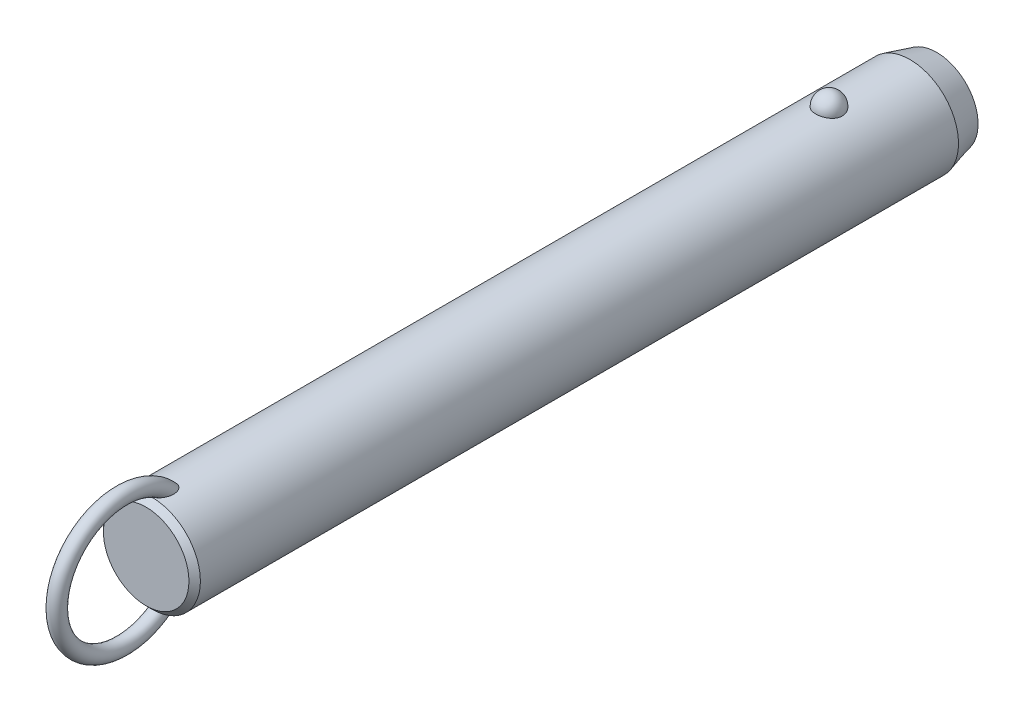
ISO-10303-21;
HEADER;
FILE_DESCRIPTION(('STEP AP214'),'2;1');
FILE_NAME('part.step','',(''),(''),'','','');
FILE_SCHEMA(('AUTOMOTIVE_DESIGN { 1 0 10303 214 1 1 1 1 }'));
ENDSEC;
DATA;
#1=APPLICATION_CONTEXT('core data for automotive mechanical design processes');
#2=APPLICATION_PROTOCOL_DEFINITION('international standard','automotive_design',2000,#1);
#3=PRODUCT_CONTEXT('',#1,'mechanical');
#4=PRODUCT('Part','Part','',(#3));
#5=PRODUCT_RELATED_PRODUCT_CATEGORY('part','',(#4));
#6=PRODUCT_DEFINITION_FORMATION('','',#4);
#7=PRODUCT_DEFINITION_CONTEXT('part definition',#1,'design');
#8=PRODUCT_DEFINITION('design','',#6,#7);
#9=PRODUCT_DEFINITION_SHAPE('','',#8);
#10=(LENGTH_UNIT() NAMED_UNIT(*) SI_UNIT(.MILLI.,.METRE.));
#11=(NAMED_UNIT(*) PLANE_ANGLE_UNIT() SI_UNIT($,.RADIAN.));
#12=(NAMED_UNIT(*) SI_UNIT($,.STERADIAN.) SOLID_ANGLE_UNIT());
#13=UNCERTAINTY_MEASURE_WITH_UNIT(LENGTH_MEASURE(1.E-05),#10,'distance_accuracy_value','');
#14=(GEOMETRIC_REPRESENTATION_CONTEXT(3) GLOBAL_UNCERTAINTY_ASSIGNED_CONTEXT((#13)) GLOBAL_UNIT_ASSIGNED_CONTEXT((#10,
#11,#12)) REPRESENTATION_CONTEXT('',''));
#15=CARTESIAN_POINT('',(0.,0.,0.));
#16=DIRECTION('',(0.,0.,1.));
#17=DIRECTION('',(1.,0.,0.));
#18=AXIS2_PLACEMENT_3D('',#15,#16,#17);
#19=CARTESIAN_POINT('',(0.,0.,162.6));
#20=DIRECTION('',(0.,0.,-1.));
#21=DIRECTION('',(-1.,0.,0.));
#22=AXIS2_PLACEMENT_3D('',#19,#20,#21);
#23=CYLINDRICAL_SURFACE('',#22,12.7);
#24=CARTESIAN_POINT('',(3.46661256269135,12.2177165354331,-3.50000000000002));
#25=CARTESIAN_POINT('',(3.4666090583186,12.2177194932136,-3.30432790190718));
#26=CARTESIAN_POINT('',(3.45063567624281,12.2222841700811,-3.10861112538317));
#27=CARTESIAN_POINT('',(3.38712451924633,12.2400345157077,-2.72271899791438));
#28=CARTESIAN_POINT('',(3.33957415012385,12.2532236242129,-2.53254588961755));
#29=CARTESIAN_POINT('',(3.2141234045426,12.286724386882,-2.16324948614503));
#30=CARTESIAN_POINT('',(3.13623639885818,12.3070329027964,-1.98412136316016));
#31=CARTESIAN_POINT('',(2.95205930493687,12.3525018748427,-1.6418059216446));
#32=CARTESIAN_POINT('',(2.84577003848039,12.3776621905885,-1.47861814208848));
#33=CARTESIAN_POINT('',(2.60688050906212,12.4301712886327,-1.17190583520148));
#34=CARTESIAN_POINT('',(2.47415697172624,12.4575299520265,-1.0284789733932));
#35=CARTESIAN_POINT('',(2.18615174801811,12.5112810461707,-0.766177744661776));
#36=CARTESIAN_POINT('',(2.03087002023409,12.5376734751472,-0.647303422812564));
#37=CARTESIAN_POINT('',(1.70237334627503,12.5864761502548,-0.437732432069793));
#38=CARTESIAN_POINT('',(1.52920948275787,12.6088972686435,-0.346958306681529));
#39=CARTESIAN_POINT('',(1.16944170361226,12.6473352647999,-0.195750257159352));
#40=CARTESIAN_POINT('',(0.982839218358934,12.663352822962,-0.135313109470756));
#41=CARTESIAN_POINT('',(0.604961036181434,12.6869706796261,-0.0473241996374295));
#42=CARTESIAN_POINT('',(0.41382314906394,12.6947125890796,-0.0192185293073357));
#43=CARTESIAN_POINT('',(0.0293827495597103,12.7014203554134,0.00517254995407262));
#44=CARTESIAN_POINT('',(-0.163919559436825,12.7003870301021,0.00146092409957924));
#45=CARTESIAN_POINT('',(-0.544374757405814,12.689735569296,-0.0373939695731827));
#46=CARTESIAN_POINT('',(-0.731575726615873,12.6802364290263,-0.0721015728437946));
#47=CARTESIAN_POINT('',(-1.09733277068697,12.6538333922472,-0.171364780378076));
#48=CARTESIAN_POINT('',(-1.27588869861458,12.6369293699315,-0.235920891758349));
#49=CARTESIAN_POINT('',(-1.6204698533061,12.5973946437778,-0.393548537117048));
#50=CARTESIAN_POINT('',(-1.78641865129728,12.5747321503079,-0.486778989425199));
#51=CARTESIAN_POINT('',(-2.10030671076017,12.5261316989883,-0.699110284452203));
#52=CARTESIAN_POINT('',(-2.24824419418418,12.5001934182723,-0.818213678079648));
#53=CARTESIAN_POINT('',(-2.52491489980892,12.4472906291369,-1.0815712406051));
#54=CARTESIAN_POINT('',(-2.65324222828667,12.4203160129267,-1.22624992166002));
#55=CARTESIAN_POINT('',(-2.88410007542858,12.3687509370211,-1.53528325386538));
#56=CARTESIAN_POINT('',(-2.98662883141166,12.3441606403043,-1.69963924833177));
#57=CARTESIAN_POINT('',(-3.16432417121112,12.2998199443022,-2.04548497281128));
#58=CARTESIAN_POINT('',(-3.23917525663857,12.2801261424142,-2.22714424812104));
#59=CARTESIAN_POINT('',(-3.35800573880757,12.248167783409,-2.60091389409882));
#60=CARTESIAN_POINT('',(-3.4019860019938,12.2359030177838,-2.79302397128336));
#61=CARTESIAN_POINT('',(-3.45784812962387,12.2202347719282,-3.18140279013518));
#62=CARTESIAN_POINT('',(-3.46986123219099,12.2167950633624,-3.37765118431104));
#63=CARTESIAN_POINT('',(-3.46186273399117,12.2190638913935,-3.76943689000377));
#64=CARTESIAN_POINT('',(-3.44185196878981,12.2247721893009,-3.96497421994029));
#65=CARTESIAN_POINT('',(-3.37048652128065,12.2446381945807,-4.34881728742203));
#66=CARTESIAN_POINT('',(-3.31928253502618,12.2587552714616,-4.53715319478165));
#67=CARTESIAN_POINT('',(-3.18693461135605,12.2938237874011,-4.9023172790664));
#68=CARTESIAN_POINT('',(-3.1057895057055,12.3147754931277,-5.07914500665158));
#69=CARTESIAN_POINT('',(-2.91506431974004,12.3613125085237,-5.41732059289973));
#70=CARTESIAN_POINT('',(-2.80533587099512,12.3869217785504,-5.57858147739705));
#71=CARTESIAN_POINT('',(-2.560414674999,12.4398525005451,-5.88013283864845));
#72=CARTESIAN_POINT('',(-2.42522099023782,12.4671740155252,-6.02042254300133));
#73=CARTESIAN_POINT('',(-2.1323357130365,12.5205965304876,-6.27662798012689));
#74=CARTESIAN_POINT('',(-1.97456596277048,12.5466928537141,-6.39245542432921));
#75=CARTESIAN_POINT('',(-1.64115839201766,12.5946384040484,-6.59583547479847));
#76=CARTESIAN_POINT('',(-1.46552179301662,12.6164879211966,-6.68339001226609));
#77=CARTESIAN_POINT('',(-1.10356050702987,12.6532533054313,-6.82682153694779));
#78=CARTESIAN_POINT('',(-0.9173913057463,12.6682500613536,-6.88306988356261));
#79=CARTESIAN_POINT('',(-0.537836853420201,12.6900288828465,-6.96386887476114));
#80=CARTESIAN_POINT('',(-0.344452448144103,12.6968119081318,-6.98842322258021));
#81=CARTESIAN_POINT('',(0.0402577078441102,12.7013667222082,-7.00496469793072));
#82=CARTESIAN_POINT('',(0.231556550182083,12.6993008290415,-6.99753844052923));
#83=CARTESIAN_POINT('',(0.610105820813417,12.6867505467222,-6.95166366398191));
#84=CARTESIAN_POINT('',(0.797356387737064,12.6762664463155,-6.91321620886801));
#85=CARTESIAN_POINT('',(1.16186657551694,12.6480587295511,-6.80658431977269));
#86=CARTESIAN_POINT('',(1.33915951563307,12.6303611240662,-6.73850666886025));
#87=CARTESIAN_POINT('',(1.67968518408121,12.5896027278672,-6.57450875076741));
#88=CARTESIAN_POINT('',(1.84291705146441,12.5665416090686,-6.47858678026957));
#89=CARTESIAN_POINT('',(2.15340192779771,12.5171072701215,-6.25982455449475));
#90=CARTESIAN_POINT('',(2.30037831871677,12.4906895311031,-6.13660186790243));
#91=CARTESIAN_POINT('',(2.5717412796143,12.4376567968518,-5.86739587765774));
#92=CARTESIAN_POINT('',(2.69612388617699,12.4110417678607,-5.72140858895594));
#93=CARTESIAN_POINT('',(2.92107785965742,12.360051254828,-5.40794137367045));
#94=CARTESIAN_POINT('',(3.02121329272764,12.3357209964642,-5.24014110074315));
#95=CARTESIAN_POINT('',(3.19236291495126,12.2925446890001,-4.88969865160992));
#96=CARTESIAN_POINT('',(3.26338839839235,12.2736965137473,-4.70706226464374));
#97=CARTESIAN_POINT('',(3.36788038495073,12.245404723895,-4.35469510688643));
#98=CARTESIAN_POINT('',(3.40484026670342,12.2351018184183,-4.18605935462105));
#99=CARTESIAN_POINT('',(3.45420764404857,12.2212564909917,-3.84496058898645));
#100=CARTESIAN_POINT('',(3.46661565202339,12.2177139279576,-3.67249765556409));
#101=CARTESIAN_POINT('',(3.46661256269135,12.2177165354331,-3.50000000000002));
#102=B_SPLINE_CURVE_WITH_KNOTS('',3,(#24,#25,#26,#27,#28,#29,#30,#31,#32,#33,#34,#35,#36,#37,
#38,#39,#40,#41,#42,#43,#44,#45,#46,#47,#48,#49,#50,#51,#52,#53,#54,#55,#56,#57,#58,#59,#60,#61,
#62,#63,#64,#65,#66,#67,#68,#69,#70,#71,#72,#73,#74,#75,#76,#77,#78,#79,#80,#81,#82,#83,#84,#85,
#86,#87,#88,#89,#90,#91,#92,#93,#94,#95,#96,#97,#98,#99,#100,#101),.UNSPECIFIED.,.T.,.F.,(4,2,2,
2,2,2,2,2,2,2,2,2,2,2,2,2,2,2,2,2,2,2,2,2,2,2,2,2,2,2,2,2,2,2,2,2,2,2,4),(0.,0.586396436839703,
1.17302689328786,1.7593990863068,2.34575431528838,2.93491084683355,3.52406845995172,
4.11158733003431,4.69904375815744,5.2762784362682,5.85345931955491,6.42265312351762,
6.99185659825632,7.56427334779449,8.136746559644,8.71981013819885,9.3029135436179,
9.89247258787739,10.4820150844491,11.0691335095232,11.6562366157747,12.2405256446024,
12.8248374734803,13.412244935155,13.9996740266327,14.5891883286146,15.1786623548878,
15.7609861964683,16.3432419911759,16.9148635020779,17.4864654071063,18.0560241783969,
18.6256177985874,19.2037609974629,19.7820055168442,20.3699810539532,20.957728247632,
21.4746855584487,21.9916320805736),.UNSPECIFIED.);
#103=CARTESIAN_POINT('',(3.46661256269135,12.2177165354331,-3.50000000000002));
#104=VERTEX_POINT('',#103);
#105=EDGE_CURVE('E41',#104,#104,#102,.T.);
#106=ORIENTED_EDGE('',*,*,#105,.T.);
#107=EDGE_LOOP('',(#106));
#108=FACE_BOUND('',#107,.T.);
#109=CARTESIAN_POINT('',(0.,0.,173.8));
#110=DIRECTION('',(0.,0.,1.));
#111=DIRECTION('',(1.,0.,0.));
#112=AXIS2_PLACEMENT_3D('',#109,#110,#111);
#113=CIRCLE('',#112,12.7);
#114=CARTESIAN_POINT('',(12.7,0.,173.8));
#115=VERTEX_POINT('',#114);
#116=EDGE_CURVE('E10',#115,#115,#113,.F.);
#117=ORIENTED_EDGE('',*,*,#116,.T.);
#118=EDGE_LOOP('',(#117));
#119=FACE_BOUND('',#118,.T.);
#120=CARTESIAN_POINT('',(-0.548122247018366,-12.6881662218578,167.543218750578));
#121=CARTESIAN_POINT('',(-0.648865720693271,-12.6838128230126,167.577926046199));
#122=CARTESIAN_POINT('',(-0.746398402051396,-12.6783867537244,167.622042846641));
#123=CARTESIAN_POINT('',(-0.932125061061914,-12.666091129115,167.726764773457));
#124=CARTESIAN_POINT('',(-1.02030388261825,-12.6592192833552,167.787396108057));
#125=CARTESIAN_POINT('',(-1.18487740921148,-12.6448747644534,167.921847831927));
#126=CARTESIAN_POINT('',(-1.26134296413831,-12.637406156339,167.995582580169));
#127=CARTESIAN_POINT('',(-1.4023120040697,-12.6225412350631,168.153604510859));
#128=CARTESIAN_POINT('',(-1.466814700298,-12.6151449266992,168.23789238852));
#129=CARTESIAN_POINT('',(-1.60714786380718,-12.5981718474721,168.449657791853));
#130=CARTESIAN_POINT('',(-1.67725126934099,-12.588900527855,168.580962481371));
#131=CARTESIAN_POINT('',(-1.79536591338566,-12.5725964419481,168.853247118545));
#132=CARTESIAN_POINT('',(-1.84333535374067,-12.5655679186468,168.994244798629));
#133=CARTESIAN_POINT('',(-1.93422576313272,-12.5519624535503,169.337645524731));
#134=CARTESIAN_POINT('',(-1.96788773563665,-12.5466298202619,169.542557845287));
#135=CARTESIAN_POINT('',(-1.9941399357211,-12.542463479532,169.851760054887));
#136=CARTESIAN_POINT('',(-1.99883864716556,-12.5417153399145,169.955298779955));
#137=CARTESIAN_POINT('',(-2.00078003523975,-12.5414074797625,170.16245124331));
#138=CARTESIAN_POINT('',(-1.99802449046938,-12.5418474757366,170.266064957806));
#139=CARTESIAN_POINT('',(-1.98336733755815,-12.5441750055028,170.51032076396));
#140=CARTESIAN_POINT('',(-1.96851430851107,-12.5465291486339,170.650780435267));
#141=CARTESIAN_POINT('',(-1.92707089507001,-12.5529612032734,170.929960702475));
#142=CARTESIAN_POINT('',(-1.90047458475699,-12.5570399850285,171.068680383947));
#143=CARTESIAN_POINT('',(-1.83619120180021,-12.5666008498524,171.34341135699));
#144=CARTESIAN_POINT('',(-1.79850828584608,-12.57208240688,171.479423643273));
#145=CARTESIAN_POINT('',(-1.71223796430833,-12.5841228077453,171.747842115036));
#146=CARTESIAN_POINT('',(-1.66365679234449,-12.5906810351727,171.880250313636));
#147=CARTESIAN_POINT('',(-1.57804503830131,-12.6016176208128,172.08548877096));
#148=CARTESIAN_POINT('',(-1.54477252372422,-12.6057501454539,172.159914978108));
#149=CARTESIAN_POINT('',(-1.47424480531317,-12.6141930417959,172.306839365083));
#150=CARTESIAN_POINT('',(-1.43699041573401,-12.6185033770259,172.379337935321));
#151=CARTESIAN_POINT('',(-1.35825795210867,-12.6272207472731,172.521892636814));
#152=CARTESIAN_POINT('',(-1.31678520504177,-12.6316276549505,172.591951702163));
#153=CARTESIAN_POINT('',(-1.22917793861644,-12.6404532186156,172.729070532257));
#154=CARTESIAN_POINT('',(-1.18304514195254,-12.6448718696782,172.796131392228));
#155=CARTESIAN_POINT('',(-1.07246411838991,-12.6547893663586,172.943874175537));
#156=CARTESIAN_POINT('',(-1.0064223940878,-12.6602600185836,173.023384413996));
#157=CARTESIAN_POINT('',(-0.864441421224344,-12.6707460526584,173.173169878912));
#158=CARTESIAN_POINT('',(-0.788516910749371,-12.6757620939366,173.243458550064));
#159=CARTESIAN_POINT('',(-0.652215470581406,-12.6833591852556,173.348680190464));
#160=CARTESIAN_POINT('',(-0.594982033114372,-12.6861973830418,173.387624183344));
#161=CARTESIAN_POINT('',(-0.475269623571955,-12.6912445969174,173.456489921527));
#162=CARTESIAN_POINT('',(-0.412800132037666,-12.6934547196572,173.486427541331));
#163=CARTESIAN_POINT('',(-0.295749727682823,-12.6966636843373,173.52975652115));
#164=CARTESIAN_POINT('',(-0.2419499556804,-12.6978134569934,173.545218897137));
#165=CARTESIAN_POINT('',(-0.13250810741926,-12.6994261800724,173.566884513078));
#166=CARTESIAN_POINT('',(-0.0768679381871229,-12.6998898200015,173.573097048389));
#167=CARTESIAN_POINT('',(0.0347696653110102,-12.7000752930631,173.575583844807));
#168=CARTESIAN_POINT('',(0.0907676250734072,-12.6997954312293,173.571835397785));
#169=CARTESIAN_POINT('',(0.20128301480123,-12.6985255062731,173.554788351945));
#170=CARTESIAN_POINT('',(0.255799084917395,-12.6975348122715,173.541481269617));
#171=CARTESIAN_POINT('',(0.376042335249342,-12.6946091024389,173.50203792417));
#172=CARTESIAN_POINT('',(0.440950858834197,-12.6924943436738,173.473449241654));
#173=CARTESIAN_POINT('',(0.56535027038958,-12.6875639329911,173.406323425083));
#174=CARTESIAN_POINT('',(0.624828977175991,-12.6847467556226,173.367764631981));
#175=CARTESIAN_POINT('',(0.774116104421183,-12.6767252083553,173.256949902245));
#176=CARTESIAN_POINT('',(0.859449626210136,-12.6711344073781,173.178760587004));
#177=CARTESIAN_POINT('',(1.01789440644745,-12.6593922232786,173.010943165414));
#178=CARTESIAN_POINT('',(1.09096902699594,-12.653239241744,172.921282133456));
#179=CARTESIAN_POINT('',(1.22268793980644,-12.6411674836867,172.740265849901));
#180=CARTESIAN_POINT('',(1.28193986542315,-12.6352572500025,172.649345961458));
#181=CARTESIAN_POINT('',(1.39259777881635,-12.6235401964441,172.462792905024));
#182=CARTESIAN_POINT('',(1.44399707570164,-12.6177334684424,172.367155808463));
#183=CARTESIAN_POINT('',(1.53972870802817,-12.6064093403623,172.172273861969));
#184=CARTESIAN_POINT('',(1.58405262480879,-12.6008922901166,172.073024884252));
#185=CARTESIAN_POINT('',(1.66600705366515,-12.5903187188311,171.871772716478));
#186=CARTESIAN_POINT('',(1.70363651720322,-12.5852622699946,171.769769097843));
#187=CARTESIAN_POINT('',(1.77545379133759,-12.5753406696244,171.554358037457));
#188=CARTESIAN_POINT('',(1.80903453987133,-12.5705328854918,171.440745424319));
#189=CARTESIAN_POINT('',(1.86844163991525,-12.5618400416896,171.211457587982));
#190=CARTESIAN_POINT('',(1.89426665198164,-12.5579551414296,171.095782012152));
#191=CARTESIAN_POINT('',(1.93785464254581,-12.5513030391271,170.863007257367));
#192=CARTESIAN_POINT('',(1.95562640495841,-12.5485346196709,170.745909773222));
#193=CARTESIAN_POINT('',(1.98264463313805,-12.5442934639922,170.510747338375));
#194=CARTESIAN_POINT('',(1.99189298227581,-12.5428204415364,170.39268260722));
#195=CARTESIAN_POINT('',(2.00416068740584,-12.540871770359,170.080622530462));
#196=CARTESIAN_POINT('',(1.99944433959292,-12.541631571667,169.886229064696));
#197=CARTESIAN_POINT('',(1.9611375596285,-12.5476846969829,169.500309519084));
#198=CARTESIAN_POINT('',(1.92758341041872,-12.5529723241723,169.308780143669));
#199=CARTESIAN_POINT('',(1.83934342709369,-12.5661532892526,168.982272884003));
#200=CARTESIAN_POINT('',(1.79215440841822,-12.5730485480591,168.84524997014));
#201=CARTESIAN_POINT('',(1.67676242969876,-12.588958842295,168.580445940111));
#202=CARTESIAN_POINT('',(1.60859050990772,-12.597970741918,168.452651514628));
#203=CARTESIAN_POINT('',(1.4658383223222,-12.6152829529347,168.235800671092));
#204=CARTESIAN_POINT('',(1.39525727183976,-12.6233659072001,168.14410500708));
#205=CARTESIAN_POINT('',(1.23992594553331,-12.6395676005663,167.973485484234));
#206=CARTESIAN_POINT('',(1.1551793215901,-12.6476863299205,167.894558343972));
#207=CARTESIAN_POINT('',(0.971995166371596,-12.6630846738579,167.752643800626));
#208=CARTESIAN_POINT('',(0.873456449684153,-12.6703572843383,167.689784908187));
#209=CARTESIAN_POINT('',(0.665847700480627,-12.6829569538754,167.584487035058));
#210=CARTESIAN_POINT('',(0.556784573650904,-12.688285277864,167.542034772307));
#211=CARTESIAN_POINT('',(0.347338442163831,-12.6956226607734,167.484443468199));
#212=CARTESIAN_POINT('',(0.247759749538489,-12.6979816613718,167.466399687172));
#213=CARTESIAN_POINT('',(0.047021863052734,-12.7003077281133,167.448600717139));
#214=CARTESIAN_POINT('',(-0.0541350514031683,-12.7002779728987,167.448821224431));
#215=CARTESIAN_POINT('',(-0.221414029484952,-12.6982482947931,167.464363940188));
#216=CARTESIAN_POINT('',(-0.288055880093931,-12.6969033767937,167.474666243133));
#217=CARTESIAN_POINT('',(-0.419599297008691,-12.6932369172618,167.50313489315));
#218=CARTESIAN_POINT('',(-0.484501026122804,-12.6909154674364,167.521300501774));
#219=CARTESIAN_POINT('',(-0.548122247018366,-12.6881662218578,167.543218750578));
#220=B_SPLINE_CURVE_WITH_KNOTS('',3,(#120,#121,#122,#123,#124,#125,#126,#127,#128,#129,#130,
#131,#132,#133,#134,#135,#136,#137,#138,#139,#140,#141,#142,#143,#144,#145,#146,#147,#148,#149,
#150,#151,#152,#153,#154,#155,#156,#157,#158,#159,#160,#161,#162,#163,#164,#165,#166,#167,#168,
#169,#170,#171,#172,#173,#174,#175,#176,#177,#178,#179,#180,#181,#182,#183,#184,#185,#186,#187,
#188,#189,#190,#191,#192,#193,#194,#195,#196,#197,#198,#199,#200,#201,#202,#203,#204,#205,#206,
#207,#208,#209,#210,#211,#212,#213,#214,#215,#216,#217,#218,#219),.UNSPECIFIED.,.T.,.F.,(4,2,2,
2,2,2,2,2,2,2,2,2,2,2,2,2,2,2,2,2,2,2,2,2,2,2,2,2,2,2,2,2,2,2,2,2,2,2,2,2,2,2,2,2,2,2,2,2,2,4),
(0.,0.31964225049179,0.639794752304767,0.957927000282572,1.27608021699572,1.72100165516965,
2.16675988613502,2.78630021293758,3.09705782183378,3.40774128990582,3.83096358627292,
4.25439969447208,4.67767724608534,5.1007133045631,5.34550297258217,5.59024267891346,
5.83467707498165,6.07902143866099,6.38891080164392,6.69834321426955,6.90560910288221,
7.11250749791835,7.27977315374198,7.44687060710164,7.61434932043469,7.78197685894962,
7.99365544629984,8.20579780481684,8.55147335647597,8.89816429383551,9.22375138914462,
9.54961437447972,9.87586224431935,10.202161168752,10.5575872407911,10.9130746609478,
11.2681734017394,11.6231936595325,12.2046601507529,12.7853961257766,13.219164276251,
13.6522938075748,13.9989174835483,14.3454519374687,14.6946768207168,15.0436740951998,
15.3457513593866,15.6474266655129,15.8493051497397,16.0511646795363),.UNSPECIFIED.);
#221=CARTESIAN_POINT('',(-0.548122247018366,-12.6881662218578,167.543218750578));
#222=VERTEX_POINT('',#221);
#223=EDGE_CURVE('E59',#222,#222,#220,.T.);
#224=ORIENTED_EDGE('',*,*,#223,.T.);
#225=EDGE_LOOP('',(#224));
#226=FACE_BOUND('',#225,.T.);
#227=CARTESIAN_POINT('',(-0.548122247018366,12.6881662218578,167.543218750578));
#228=CARTESIAN_POINT('',(-0.459436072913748,12.6919968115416,167.512673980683));
#229=CARTESIAN_POINT('',(-0.368189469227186,12.6949996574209,167.489391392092));
#230=CARTESIAN_POINT('',(-0.183024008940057,12.6990186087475,167.458406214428));
#231=CARTESIAN_POINT('',(-0.089104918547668,12.7000345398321,167.450704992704));
#232=CARTESIAN_POINT('',(0.0987147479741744,12.6999636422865,167.451245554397));
#233=CARTESIAN_POINT('',(0.192615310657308,12.6988761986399,167.459492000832));
#234=CARTESIAN_POINT('',(0.377658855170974,12.6947211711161,167.491551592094));
#235=CARTESIAN_POINT('',(0.468801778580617,12.6916535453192,167.515365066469));
#236=CARTESIAN_POINT('',(0.645809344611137,12.6838788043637,167.57745651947));
#237=CARTESIAN_POINT('',(0.731679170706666,12.6791733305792,167.615720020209));
#238=CARTESIAN_POINT('',(0.896315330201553,12.6686004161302,167.705120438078));
#239=CARTESIAN_POINT('',(0.97508059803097,12.6627328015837,167.756259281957));
#240=CARTESIAN_POINT('',(1.12963655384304,12.6499161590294,167.87367820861));
#241=CARTESIAN_POINT('',(1.20478673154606,12.6429194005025,167.940792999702));
#242=CARTESIAN_POINT('',(1.34448241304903,12.6288282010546,168.08522507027));
#243=CARTESIAN_POINT('',(1.40902173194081,12.621733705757,168.162548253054));
#244=CARTESIAN_POINT('',(1.55208211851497,12.6050877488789,168.359247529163));
#245=CARTESIAN_POINT('',(1.62510490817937,12.5957546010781,168.482654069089));
#246=CARTESIAN_POINT('',(1.7501904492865,12.5789823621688,168.739769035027));
#247=CARTESIAN_POINT('',(1.8022137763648,12.5715468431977,168.873496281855));
#248=CARTESIAN_POINT('',(1.90309965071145,12.5567434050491,169.198351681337));
#249=CARTESIAN_POINT('',(1.94342317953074,12.5504515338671,169.392161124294));
#250=CARTESIAN_POINT('',(1.99332997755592,12.5426147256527,169.78378810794));
#251=CARTESIAN_POINT('',(2.00285305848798,12.5410790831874,169.981612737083));
#252=CARTESIAN_POINT('',(1.99678999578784,12.5420407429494,170.316642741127));
#253=CARTESIAN_POINT('',(1.98794117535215,12.5434564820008,170.454042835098));
#254=CARTESIAN_POINT('',(1.95865119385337,12.5480641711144,170.727639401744));
#255=CARTESIAN_POINT('',(1.93820436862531,12.5512569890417,170.863835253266));
#256=CARTESIAN_POINT('',(1.88647896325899,12.5591352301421,171.134249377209));
#257=CARTESIAN_POINT('',(1.85518800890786,12.5638223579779,171.268465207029));
#258=CARTESIAN_POINT('',(1.78217886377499,12.5743868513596,171.533936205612));
#259=CARTESIAN_POINT('',(1.74046509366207,12.5802637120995,171.665192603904));
#260=CARTESIAN_POINT('',(1.66024095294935,12.5910571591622,171.886085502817));
#261=CARTESIAN_POINT('',(1.62434772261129,12.5957535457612,171.976690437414));
#262=CARTESIAN_POINT('',(1.54709009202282,12.6054762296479,172.155512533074));
#263=CARTESIAN_POINT('',(1.50572681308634,12.6105024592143,172.243730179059));
#264=CARTESIAN_POINT('',(1.41728020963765,12.620748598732,172.416932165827));
#265=CARTESIAN_POINT('',(1.37021377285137,12.625967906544,172.501925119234));
#266=CARTESIAN_POINT('',(1.26969620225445,12.6364721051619,172.668007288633));
#267=CARTESIAN_POINT('',(1.21624929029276,12.6417569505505,172.749099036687));
#268=CARTESIAN_POINT('',(1.1030441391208,12.6521331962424,172.904702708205));
#269=CARTESIAN_POINT('',(1.04340936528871,12.657226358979,172.979303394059));
#270=CARTESIAN_POINT('',(0.915919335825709,12.667090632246,173.121324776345));
#271=CARTESIAN_POINT('',(0.848064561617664,12.6718617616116,173.18874589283));
#272=CARTESIAN_POINT('',(0.717035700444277,12.67987711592,173.300624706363));
#273=CARTESIAN_POINT('',(0.655526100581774,12.6832377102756,173.346997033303));
#274=CARTESIAN_POINT('',(0.525985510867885,12.6892676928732,173.429619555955));
#275=CARTESIAN_POINT('',(0.457969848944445,12.6919386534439,173.465892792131));
#276=CARTESIAN_POINT('',(0.334859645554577,12.695691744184,173.516657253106));
#277=CARTESIAN_POINT('',(0.281116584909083,12.6970073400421,173.534373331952));
#278=CARTESIAN_POINT('',(0.171425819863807,12.6989609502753,173.560642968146));
#279=CARTESIAN_POINT('',(0.115480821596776,12.699599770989,173.569207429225));
#280=CARTESIAN_POINT('',(0.00272618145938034,12.7001251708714,173.576253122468));
#281=CARTESIAN_POINT('',(-0.0540859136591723,12.7000089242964,173.574696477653));
#282=CARTESIAN_POINT('',(-0.16654462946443,12.6990328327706,173.561600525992));
#283=CARTESIAN_POINT('',(-0.222190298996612,12.6981724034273,173.550053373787));
#284=CARTESIAN_POINT('',(-0.342018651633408,12.695562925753,173.514912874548));
#285=CARTESIAN_POINT('',(-0.405606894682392,12.6936676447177,173.48933225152));
#286=CARTESIAN_POINT('',(-0.527815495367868,12.6891754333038,173.428311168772));
#287=CARTESIAN_POINT('',(-0.586425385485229,12.6865770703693,173.392850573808));
#288=CARTESIAN_POINT('',(-0.731842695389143,12.6792129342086,173.291496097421));
#289=CARTESIAN_POINT('',(-0.81470941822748,12.6740767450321,173.2200395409));
#290=CARTESIAN_POINT('',(-0.969101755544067,12.6632083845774,173.06589007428));
#291=CARTESIAN_POINT('',(-1.04059564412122,12.6574746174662,172.983166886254));
#292=CARTESIAN_POINT('',(-1.16981116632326,12.6461638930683,172.815809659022));
#293=CARTESIAN_POINT('',(-1.22811369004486,12.6405994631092,172.731616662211));
#294=CARTESIAN_POINT('',(-1.33743405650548,12.6295007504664,172.558579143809));
#295=CARTESIAN_POINT('',(-1.38844577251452,12.6239664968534,172.469730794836));
#296=CARTESIAN_POINT('',(-1.48400702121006,12.6130898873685,172.288389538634));
#297=CARTESIAN_POINT('',(-1.52854232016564,12.6077479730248,172.195889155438));
#298=CARTESIAN_POINT('',(-1.61150113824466,12.5974127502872,172.008160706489));
#299=CARTESIAN_POINT('',(-1.64992317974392,12.5924195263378,171.912931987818));
#300=CARTESIAN_POINT('',(-1.73468589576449,12.581070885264,171.68289362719));
#301=CARTESIAN_POINT('',(-1.77831261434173,12.5749388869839,171.547066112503));
#302=CARTESIAN_POINT('',(-1.85439734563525,12.5639437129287,171.272212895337));
#303=CARTESIAN_POINT('',(-1.88684994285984,12.5590811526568,171.133185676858));
#304=CARTESIAN_POINT('',(-1.94008483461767,12.550968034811,170.85309235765));
#305=CARTESIAN_POINT('',(-1.96088706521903,12.5477147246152,170.712030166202));
#306=CARTESIAN_POINT('',(-1.99000539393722,12.5431291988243,170.428668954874));
#307=CARTESIAN_POINT('',(-1.99832911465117,12.5417958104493,170.286370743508));
#308=CARTESIAN_POINT('',(-2.00166624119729,12.5412674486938,169.957627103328));
#309=CARTESIAN_POINT('',(-1.99178843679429,12.5428579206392,169.771088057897));
#310=CARTESIAN_POINT('',(-1.94455183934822,12.5502731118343,169.40162404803));
#311=CARTESIAN_POINT('',(-1.90724032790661,12.5560905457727,169.218693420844));
#312=CARTESIAN_POINT('',(-1.81330718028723,12.5699462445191,168.904848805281));
#313=CARTESIAN_POINT('',(-1.76338820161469,12.5771273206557,168.771910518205));
#314=CARTESIAN_POINT('',(-1.64305018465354,12.593414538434,168.515681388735));
#315=CARTESIAN_POINT('',(-1.57265346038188,12.6025185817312,168.392380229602));
#316=CARTESIAN_POINT('',(-1.42634956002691,12.6198178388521,168.183564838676));
#317=CARTESIAN_POINT('',(-1.35423772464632,12.6278405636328,168.095384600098));
#318=CARTESIAN_POINT('',(-1.19645664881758,12.6437632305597,167.932107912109));
#319=CARTESIAN_POINT('',(-1.1108053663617,12.6516633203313,167.856994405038));
#320=CARTESIAN_POINT('',(-0.947219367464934,12.6648319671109,167.737811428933));
#321=CARTESIAN_POINT('',(-0.871624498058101,12.670300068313,167.690541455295));
#322=CARTESIAN_POINT('',(-0.714161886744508,12.6801492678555,167.6077413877));
#323=CARTESIAN_POINT('',(-0.632295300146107,12.684530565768,167.57220913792));
#324=CARTESIAN_POINT('',(-0.548122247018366,12.6881662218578,167.543218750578));
#325=B_SPLINE_CURVE_WITH_KNOTS('',3,(#227,#228,#229,#230,#231,#232,#233,#234,#235,#236,#237,
#238,#239,#240,#241,#242,#243,#244,#245,#246,#247,#248,#249,#250,#251,#252,#253,#254,#255,#256,
#257,#258,#259,#260,#261,#262,#263,#264,#265,#266,#267,#268,#269,#270,#271,#272,#273,#274,#275,
#276,#277,#278,#279,#280,#281,#282,#283,#284,#285,#286,#287,#288,#289,#290,#291,#292,#293,#294,
#295,#296,#297,#298,#299,#300,#301,#302,#303,#304,#305,#306,#307,#308,#309,#310,#311,#312,#313,
#314,#315,#316,#317,#318,#319,#320,#321,#322,#323,#324),.UNSPECIFIED.,.T.,.F.,(4,2,2,2,2,2,2,2,
2,2,2,2,2,2,2,2,2,2,2,2,2,2,2,2,2,2,2,2,2,2,2,2,2,2,2,2,2,2,2,2,2,2,2,2,2,2,2,2,4),(0.,
0.281328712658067,0.562682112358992,0.844117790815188,1.12555942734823,1.40671982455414,
1.68792232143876,1.98972294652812,2.29169886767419,2.72039860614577,3.14989948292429,
3.74084916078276,4.33295293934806,4.74554109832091,5.15833092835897,5.57159335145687,
5.98468079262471,6.27722775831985,6.56971484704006,6.86135609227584,7.15280542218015,
7.43927407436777,7.72572595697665,7.95635862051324,8.18646071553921,8.35559393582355,
8.52452541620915,8.69408946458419,8.86378678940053,9.06834348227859,9.27332014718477,
9.60010414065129,9.92778432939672,10.2350252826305,10.5425229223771,10.8506864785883,
11.15892440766,11.5867893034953,12.0148612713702,12.4421984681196,12.8692745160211,
13.4279365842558,13.9856380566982,14.4107062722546,14.835313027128,15.1765567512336,
15.517351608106,15.7844129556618,16.051425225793),.UNSPECIFIED.);
#326=CARTESIAN_POINT('',(-0.548122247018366,12.6881662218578,167.543218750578));
#327=VERTEX_POINT('',#326);
#328=EDGE_CURVE('E67',#327,#327,#325,.T.);
#329=ORIENTED_EDGE('',*,*,#328,.T.);
#330=EDGE_LOOP('',(#329));
#331=FACE_BOUND('',#330,.T.);
#332=CARTESIAN_POINT('',(0.,0.,-24.6999999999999));
#333=DIRECTION('',(0.,0.,-1.));
#334=DIRECTION('',(-1.,0.,0.));
#335=AXIS2_PLACEMENT_3D('',#332,#333,#334);
#336=CIRCLE('',#335,12.7);
#337=CARTESIAN_POINT('',(-12.7,0.,-24.6999999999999));
#338=VERTEX_POINT('',#337);
#339=EDGE_CURVE('E56',#338,#338,#336,.F.);
#340=ORIENTED_EDGE('',*,*,#339,.T.);
#341=EDGE_LOOP('',(#340));
#342=FACE_BOUND('',#341,.T.);
#343=ADVANCED_FACE('F37',(#108,#119,#226,#331,#342),#23,.T.);
#344=CARTESIAN_POINT('',(0.,0.,-31.7));
#345=DIRECTION('',(0.,0.,-1.));
#346=DIRECTION('',(-1.,0.,0.));
#347=AXIS2_PLACEMENT_3D('',#344,#345,#346);
#348=PLANE('',#347);
#349=CARTESIAN_POINT('',(0.,0.,-31.7));
#350=DIRECTION('',(0.,0.,-1.));
#351=DIRECTION('',(-1.,0.,0.));
#352=AXIS2_PLACEMENT_3D('',#349,#350,#351);
#353=CIRCLE('',#352,10.8243556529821);
#354=CARTESIAN_POINT('',(-10.8243556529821,0.,-31.7));
#355=VERTEX_POINT('',#354);
#356=EDGE_CURVE('E66',#355,#355,#353,.T.);
#357=ORIENTED_EDGE('',*,*,#356,.T.);
#358=EDGE_LOOP('',(#357));
#359=FACE_BOUND('',#358,.T.);
#360=ADVANCED_FACE('F85',(#359),#348,.T.);
#361=CARTESIAN_POINT('',(0.,0.,-31.7));
#362=DIRECTION('',(0.,0.,1.));
#363=DIRECTION('',(1.,0.,0.));
#364=AXIS2_PLACEMENT_3D('',#361,#362,#363);
#365=CONICAL_SURFACE('',#364,10.8243556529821,0.261799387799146);
#366=ORIENTED_EDGE('',*,*,#339,.F.);
#367=EDGE_LOOP('',(#366));
#368=FACE_BOUND('',#367,.T.);
#369=ORIENTED_EDGE('',*,*,#356,.F.);
#370=EDGE_LOOP('',(#369));
#371=FACE_BOUND('',#370,.T.);
#372=ADVANCED_FACE('F83',(#368,#371),#365,.T.);
#373=CARTESIAN_POINT('',(0.,0.,175.3));
#374=DIRECTION('',(0.,0.,1.));
#375=DIRECTION('',(1.,0.,0.));
#376=AXIS2_PLACEMENT_3D('',#373,#374,#375);
#377=PLANE('',#376);
#378=CARTESIAN_POINT('',(0.,0.,175.3));
#379=DIRECTION('',(0.,0.,1.));
#380=DIRECTION('',(1.,0.,0.));
#381=AXIS2_PLACEMENT_3D('',#378,#379,#380);
#382=CIRCLE('',#381,11.2);
#383=CARTESIAN_POINT('',(11.2,0.,175.3));
#384=VERTEX_POINT('',#383);
#385=EDGE_CURVE('E50',#384,#384,#382,.T.);
#386=ORIENTED_EDGE('',*,*,#385,.T.);
#387=EDGE_LOOP('',(#386));
#388=FACE_BOUND('',#387,.T.);
#389=ADVANCED_FACE('F77',(#388),#377,.T.);
#390=CARTESIAN_POINT('',(0.,0.,181.65));
#391=DIRECTION('',(1.,0.,0.));
#392=DIRECTION('',(0.,0.,-1.));
#393=AXIS2_PLACEMENT_3D('',#390,#391,#392);
#394=TOROIDAL_SURFACE('',#393,17.05,2.);
#395=ORIENTED_EDGE('',*,*,#328,.F.);
#396=EDGE_LOOP('',(#395));
#397=FACE_BOUND('',#396,.T.);
#398=ORIENTED_EDGE('',*,*,#223,.F.);
#399=EDGE_LOOP('',(#398));
#400=FACE_BOUND('',#399,.T.);
#401=ADVANCED_FACE('F73',(#397,#400),#394,.T.);
#402=CARTESIAN_POINT('',(0.,0.,175.3));
#403=DIRECTION('',(0.,0.,-1.));
#404=DIRECTION('',(-1.,0.,0.));
#405=AXIS2_PLACEMENT_3D('',#402,#403,#404);
#406=CONICAL_SURFACE('',#405,11.2,0.785398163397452);
#407=ORIENTED_EDGE('',*,*,#116,.F.);
#408=EDGE_LOOP('',(#407));
#409=FACE_BOUND('',#408,.T.);
#410=ORIENTED_EDGE('',*,*,#385,.F.);
#411=EDGE_LOOP('',(#410));
#412=FACE_BOUND('',#411,.T.);
#413=ADVANCED_FACE('F39',(#409,#412),#406,.T.);
#414=CARTESIAN_POINT('',(0.,12.7,-3.50000000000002));
#415=DIRECTION('',(0.,1.,0.));
#416=DIRECTION('',(0.,0.,-1.));
#417=AXIS2_PLACEMENT_3D('',#414,#415,#416);
#418=SPHERICAL_SURFACE('',#417,3.5);
#419=ORIENTED_EDGE('',*,*,#105,.F.);
#420=EDGE_LOOP('',(#419));
#421=FACE_BOUND('',#420,.T.);
#422=ADVANCED_FACE('F79',(#421),#418,.T.);
#423=CLOSED_SHELL('',(#343,#360,#372,#389,#401,#413,#422));
#424=MANIFOLD_SOLID_BREP('B2',#423);
#425=ADVANCED_BREP_SHAPE_REPRESENTATION('',(#18,#424),#14);
#426=SHAPE_DEFINITION_REPRESENTATION(#9,#425);
ENDSEC;
END-ISO-10303-21;
